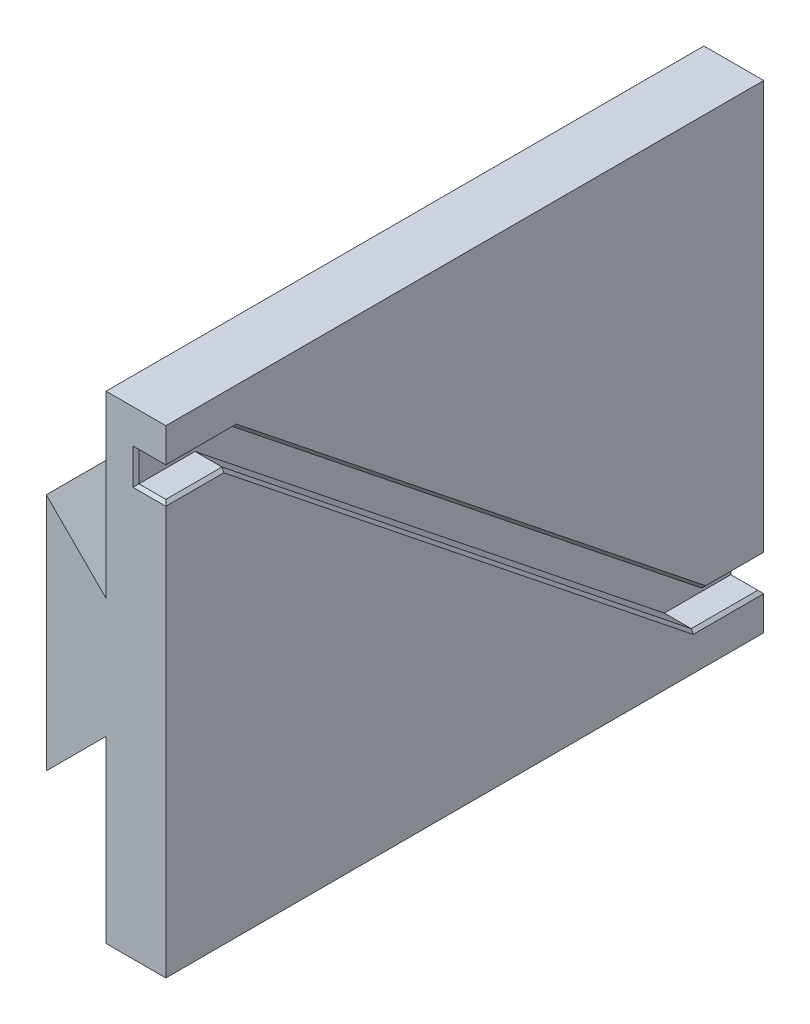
ISO-10303-21;
HEADER;
FILE_DESCRIPTION(('STEP AP214'),'2;1');
FILE_NAME('part.step','',(''),(''),'','','');
FILE_SCHEMA(('AUTOMOTIVE_DESIGN { 1 0 10303 214 1 1 1 1 }'));
ENDSEC;
DATA;
#1=APPLICATION_CONTEXT('core data for automotive mechanical design processes');
#2=APPLICATION_PROTOCOL_DEFINITION('international standard','automotive_design',2000,#1);
#3=PRODUCT_CONTEXT('',#1,'mechanical');
#4=PRODUCT('Part','Part','',(#3));
#5=PRODUCT_RELATED_PRODUCT_CATEGORY('part','',(#4));
#6=PRODUCT_DEFINITION_FORMATION('','',#4);
#7=PRODUCT_DEFINITION_CONTEXT('part definition',#1,'design');
#8=PRODUCT_DEFINITION('design','',#6,#7);
#9=PRODUCT_DEFINITION_SHAPE('','',#8);
#10=(LENGTH_UNIT() NAMED_UNIT(*) SI_UNIT(.MILLI.,.METRE.));
#11=(NAMED_UNIT(*) PLANE_ANGLE_UNIT() SI_UNIT($,.RADIAN.));
#12=(NAMED_UNIT(*) SI_UNIT($,.STERADIAN.) SOLID_ANGLE_UNIT());
#13=UNCERTAINTY_MEASURE_WITH_UNIT(LENGTH_MEASURE(1.E-05),#10,'distance_accuracy_value','');
#14=(GEOMETRIC_REPRESENTATION_CONTEXT(3) GLOBAL_UNCERTAINTY_ASSIGNED_CONTEXT((#13)) GLOBAL_UNIT_ASSIGNED_CONTEXT((#10,
#11,#12)) REPRESENTATION_CONTEXT('',''));
#15=CARTESIAN_POINT('',(0.,0.,0.));
#16=DIRECTION('',(0.,0.,1.));
#17=DIRECTION('',(1.,0.,0.));
#18=AXIS2_PLACEMENT_3D('',#15,#16,#17);
#19=CARTESIAN_POINT('',(0.,80.,100.));
#20=DIRECTION('',(-1.,0.,0.));
#21=DIRECTION('',(0.,0.,1.));
#22=AXIS2_PLACEMENT_3D('',#19,#20,#21);
#23=PLANE('',#22);
#24=DIRECTION('',(0.,-0.623846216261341,-0.781547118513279));
#25=VECTOR('',#24,1.);
#26=CARTESIAN_POINT('',(0.,84.5805321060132,96.3437295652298));
#27=LINE('',#26,#25);
#28=CARTESIAN_POINT('',(0.,68.660237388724,76.3989737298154));
#29=VERTEX_POINT('',#28);
#30=CARTESIAN_POINT('',(0.,-56.6602373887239,-80.6010262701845));
#31=VERTEX_POINT('',#30);
#32=EDGE_CURVE('E311',#29,#31,#27,.T.);
#33=ORIENTED_EDGE('',*,*,#32,.T.);
#34=DIRECTION('',(0.,0.,-1.));
#35=VECTOR('',#34,1.);
#36=CARTESIAN_POINT('',(0.,-56.6602373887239,100.));
#37=LINE('',#36,#35);
#38=CARTESIAN_POINT('',(0.,-56.6602373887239,-100.));
#39=VERTEX_POINT('',#38);
#40=EDGE_CURVE('E315',#31,#39,#37,.T.);
#41=ORIENTED_EDGE('',*,*,#40,.T.);
#42=DIRECTION('',(0.,1.,0.));
#43=VECTOR('',#42,1.);
#44=CARTESIAN_POINT('',(0.,80.,-100.));
#45=LINE('',#44,#43);
#46=CARTESIAN_POINT('',(0.,80.,-100.));
#47=VERTEX_POINT('',#46);
#48=EDGE_CURVE('E223',#39,#47,#45,.T.);
#49=ORIENTED_EDGE('',*,*,#48,.T.);
#50=DIRECTION('',(0.,0.,-1.));
#51=VECTOR('',#50,1.);
#52=CARTESIAN_POINT('',(0.,80.,100.));
#53=LINE('',#52,#51);
#54=CARTESIAN_POINT('',(0.,80.,100.));
#55=VERTEX_POINT('',#54);
#56=EDGE_CURVE('E283',#55,#47,#53,.T.);
#57=ORIENTED_EDGE('',*,*,#56,.F.);
#58=DIRECTION('',(0.,1.,0.));
#59=VECTOR('',#58,1.);
#60=CARTESIAN_POINT('',(0.,80.,100.));
#61=LINE('',#60,#59);
#62=CARTESIAN_POINT('',(0.,68.660237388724,100.));
#63=VERTEX_POINT('',#62);
#64=EDGE_CURVE('E231',#63,#55,#61,.T.);
#65=ORIENTED_EDGE('',*,*,#64,.F.);
#66=DIRECTION('',(0.,0.,-1.));
#67=VECTOR('',#66,1.);
#68=CARTESIAN_POINT('',(0.,68.660237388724,100.));
#69=LINE('',#68,#67);
#70=EDGE_CURVE('E313',#63,#29,#69,.T.);
#71=ORIENTED_EDGE('',*,*,#70,.T.);
#72=EDGE_LOOP('',(#33,#41,#49,#57,#65,#71));
#73=FACE_BOUND('',#72,.T.);
#74=ADVANCED_FACE('F35',(#73),#23,.F.);
#75=CARTESIAN_POINT('',(0.,-80.,-100.));
#76=VERTEX_POINT('',#75);
#77=CARTESIAN_POINT('',(0.,-68.660237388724,-100.));
#78=VERTEX_POINT('',#77);
#79=EDGE_CURVE('E246',#76,#78,#45,.T.);
#80=ORIENTED_EDGE('',*,*,#79,.T.);
#81=DIRECTION('',(0.,0.,1.));
#82=VECTOR('',#81,1.);
#83=CARTESIAN_POINT('',(0.,-68.660237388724,100.));
#84=LINE('',#83,#82);
#85=CARTESIAN_POINT('',(0.,-68.660237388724,-76.3989737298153));
#86=VERTEX_POINT('',#85);
#87=EDGE_CURVE('E309',#78,#86,#84,.T.);
#88=ORIENTED_EDGE('',*,*,#87,.T.);
#89=DIRECTION('',(0.,0.623846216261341,0.781547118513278));
#90=VECTOR('',#89,1.);
#91=CARTESIAN_POINT('',(0.,75.2019666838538,103.829884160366));
#92=LINE('',#91,#90);
#93=CARTESIAN_POINT('',(0.,56.6602373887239,80.6010262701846));
#94=VERTEX_POINT('',#93);
#95=EDGE_CURVE('E307',#86,#94,#92,.T.);
#96=ORIENTED_EDGE('',*,*,#95,.T.);
#97=DIRECTION('',(0.,0.,1.));
#98=VECTOR('',#97,1.);
#99=CARTESIAN_POINT('',(0.,56.6602373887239,100.));
#100=LINE('',#99,#98);
#101=CARTESIAN_POINT('',(0.,56.6602373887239,100.));
#102=VERTEX_POINT('',#101);
#103=EDGE_CURVE('E305',#94,#102,#100,.T.);
#104=ORIENTED_EDGE('',*,*,#103,.T.);
#105=CARTESIAN_POINT('',(0.,-80.,100.));
#106=VERTEX_POINT('',#105);
#107=EDGE_CURVE('E227',#106,#102,#61,.T.);
#108=ORIENTED_EDGE('',*,*,#107,.F.);
#109=DIRECTION('',(0.,0.,-1.));
#110=VECTOR('',#109,1.);
#111=CARTESIAN_POINT('',(0.,-80.,100.));
#112=LINE('',#111,#110);
#113=EDGE_CURVE('E245',#106,#76,#112,.T.);
#114=ORIENTED_EDGE('',*,*,#113,.T.);
#115=EDGE_LOOP('',(#80,#88,#96,#104,#108,#114));
#116=FACE_BOUND('',#115,.T.);
#117=ADVANCED_FACE('F435',(#116),#23,.F.);
#118=CARTESIAN_POINT('',(0.,80.,100.));
#119=DIRECTION('',(0.,-1.,0.));
#120=DIRECTION('',(0.,0.,-1.));
#121=AXIS2_PLACEMENT_3D('',#118,#119,#120);
#122=PLANE('',#121);
#123=DIRECTION('',(-1.,0.,0.));
#124=VECTOR('',#123,1.);
#125=CARTESIAN_POINT('',(0.,80.,-100.));
#126=LINE('',#125,#124);
#127=CARTESIAN_POINT('',(-20.,80.,-100.));
#128=VERTEX_POINT('',#127);
#129=EDGE_CURVE('E249',#47,#128,#126,.T.);
#130=ORIENTED_EDGE('',*,*,#129,.T.);
#131=DIRECTION('',(0.,0.,-1.));
#132=VECTOR('',#131,1.);
#133=CARTESIAN_POINT('',(-20.,80.,100.));
#134=LINE('',#133,#132);
#135=CARTESIAN_POINT('',(-20.,80.,100.));
#136=VERTEX_POINT('',#135);
#137=EDGE_CURVE('E280',#136,#128,#134,.T.);
#138=ORIENTED_EDGE('',*,*,#137,.F.);
#139=DIRECTION('',(-1.,0.,0.));
#140=VECTOR('',#139,1.);
#141=CARTESIAN_POINT('',(0.,80.,100.));
#142=LINE('',#141,#140);
#143=EDGE_CURVE('E230',#55,#136,#142,.T.);
#144=ORIENTED_EDGE('',*,*,#143,.F.);
#145=ORIENTED_EDGE('',*,*,#56,.T.);
#146=EDGE_LOOP('',(#130,#138,#144,#145));
#147=FACE_BOUND('',#146,.T.);
#148=ADVANCED_FACE('F399',(#147),#122,.F.);
#149=CARTESIAN_POINT('',(-20.,80.,100.));
#150=DIRECTION('',(1.,0.,0.));
#151=DIRECTION('',(0.,1.,0.));
#152=AXIS2_PLACEMENT_3D('',#149,#150,#151);
#153=PLANE('',#152);
#154=DIRECTION('',(0.,-1.,0.));
#155=VECTOR('',#154,1.);
#156=CARTESIAN_POINT('',(-20.,80.,-100.));
#157=LINE('',#156,#155);
#158=CARTESIAN_POINT('',(-20.,20.,-100.));
#159=VERTEX_POINT('',#158);
#160=EDGE_CURVE('E251',#128,#159,#157,.T.);
#161=ORIENTED_EDGE('',*,*,#160,.T.);
#162=DIRECTION('',(0.,0.,-1.));
#163=VECTOR('',#162,1.);
#164=CARTESIAN_POINT('',(-20.,20.,100.));
#165=LINE('',#164,#163);
#166=CARTESIAN_POINT('',(-20.,20.,100.));
#167=VERTEX_POINT('',#166);
#168=EDGE_CURVE('E277',#167,#159,#165,.T.);
#169=ORIENTED_EDGE('',*,*,#168,.F.);
#170=DIRECTION('',(0.,-1.,0.));
#171=VECTOR('',#170,1.);
#172=CARTESIAN_POINT('',(-20.,80.,100.));
#173=LINE('',#172,#171);
#174=EDGE_CURVE('E233',#136,#167,#173,.T.);
#175=ORIENTED_EDGE('',*,*,#174,.F.);
#176=ORIENTED_EDGE('',*,*,#137,.T.);
#177=EDGE_LOOP('',(#161,#169,#175,#176));
#178=FACE_BOUND('',#177,.T.);
#179=ADVANCED_FACE('F464',(#178),#153,.F.);
#180=CARTESIAN_POINT('',(-20.,20.,100.));
#181=DIRECTION('',(-0.707106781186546,-0.707106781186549,0.));
#182=DIRECTION('',(0.707106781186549,-0.707106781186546,0.));
#183=AXIS2_PLACEMENT_3D('',#180,#181,#182);
#184=PLANE('',#183);
#185=DIRECTION('',(-0.707106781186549,0.707106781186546,0.));
#186=VECTOR('',#185,1.);
#187=CARTESIAN_POINT('',(-20.,20.,-100.));
#188=LINE('',#187,#186);
#189=CARTESIAN_POINT('',(-40.,39.9999999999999,-100.));
#190=VERTEX_POINT('',#189);
#191=EDGE_CURVE('E253',#159,#190,#188,.T.);
#192=ORIENTED_EDGE('',*,*,#191,.T.);
#193=DIRECTION('',(0.,0.,-1.));
#194=VECTOR('',#193,1.);
#195=CARTESIAN_POINT('',(-40.,39.9999999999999,100.));
#196=LINE('',#195,#194);
#197=CARTESIAN_POINT('',(-40.,39.9999999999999,100.));
#198=VERTEX_POINT('',#197);
#199=EDGE_CURVE('E274',#198,#190,#196,.T.);
#200=ORIENTED_EDGE('',*,*,#199,.F.);
#201=DIRECTION('',(-0.707106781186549,0.707106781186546,0.));
#202=VECTOR('',#201,1.);
#203=CARTESIAN_POINT('',(-20.,20.,100.));
#204=LINE('',#203,#202);
#205=EDGE_CURVE('E235',#167,#198,#204,.T.);
#206=ORIENTED_EDGE('',*,*,#205,.F.);
#207=ORIENTED_EDGE('',*,*,#168,.T.);
#208=EDGE_LOOP('',(#192,#200,#206,#207));
#209=FACE_BOUND('',#208,.T.);
#210=ADVANCED_FACE('F459',(#209),#184,.F.);
#211=CARTESIAN_POINT('',(-40.,39.9999999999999,100.));
#212=DIRECTION('',(1.,0.,0.));
#213=DIRECTION('',(0.,0.,-1.));
#214=AXIS2_PLACEMENT_3D('',#211,#212,#213);
#215=PLANE('',#214);
#216=DIRECTION('',(0.,-1.,0.));
#217=VECTOR('',#216,1.);
#218=CARTESIAN_POINT('',(-40.,39.9999999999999,-100.));
#219=LINE('',#218,#217);
#220=CARTESIAN_POINT('',(-40.,-39.9999999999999,-100.));
#221=VERTEX_POINT('',#220);
#222=EDGE_CURVE('E255',#190,#221,#219,.T.);
#223=ORIENTED_EDGE('',*,*,#222,.T.);
#224=DIRECTION('',(0.,0.,-1.));
#225=VECTOR('',#224,1.);
#226=CARTESIAN_POINT('',(-40.,-39.9999999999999,100.));
#227=LINE('',#226,#225);
#228=CARTESIAN_POINT('',(-40.,-39.9999999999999,100.));
#229=VERTEX_POINT('',#228);
#230=EDGE_CURVE('E271',#229,#221,#227,.T.);
#231=ORIENTED_EDGE('',*,*,#230,.F.);
#232=DIRECTION('',(0.,-1.,0.));
#233=VECTOR('',#232,1.);
#234=CARTESIAN_POINT('',(-40.,39.9999999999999,100.));
#235=LINE('',#234,#233);
#236=EDGE_CURVE('E237',#198,#229,#235,.T.);
#237=ORIENTED_EDGE('',*,*,#236,.F.);
#238=ORIENTED_EDGE('',*,*,#199,.T.);
#239=EDGE_LOOP('',(#223,#231,#237,#238));
#240=FACE_BOUND('',#239,.T.);
#241=ADVANCED_FACE('F456',(#240),#215,.F.);
#242=CARTESIAN_POINT('',(-20.,-20.,100.));
#243=DIRECTION('',(-0.707106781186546,0.707106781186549,0.));
#244=DIRECTION('',(-0.707106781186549,-0.707106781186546,0.));
#245=AXIS2_PLACEMENT_3D('',#242,#243,#244);
#246=PLANE('',#245);
#247=DIRECTION('',(0.707106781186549,0.707106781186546,0.));
#248=VECTOR('',#247,1.);
#249=CARTESIAN_POINT('',(-20.,-20.,-100.));
#250=LINE('',#249,#248);
#251=CARTESIAN_POINT('',(-20.,-20.,-100.));
#252=VERTEX_POINT('',#251);
#253=EDGE_CURVE('E257',#221,#252,#250,.T.);
#254=ORIENTED_EDGE('',*,*,#253,.T.);
#255=DIRECTION('',(0.,0.,-1.));
#256=VECTOR('',#255,1.);
#257=CARTESIAN_POINT('',(-20.,-20.,100.));
#258=LINE('',#257,#256);
#259=CARTESIAN_POINT('',(-20.,-20.,100.));
#260=VERTEX_POINT('',#259);
#261=EDGE_CURVE('E268',#260,#252,#258,.T.);
#262=ORIENTED_EDGE('',*,*,#261,.F.);
#263=DIRECTION('',(0.707106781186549,0.707106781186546,0.));
#264=VECTOR('',#263,1.);
#265=CARTESIAN_POINT('',(-20.,-20.,100.));
#266=LINE('',#265,#264);
#267=EDGE_CURVE('E239',#229,#260,#266,.T.);
#268=ORIENTED_EDGE('',*,*,#267,.F.);
#269=ORIENTED_EDGE('',*,*,#230,.T.);
#270=EDGE_LOOP('',(#254,#262,#268,#269));
#271=FACE_BOUND('',#270,.T.);
#272=ADVANCED_FACE('F452',(#271),#246,.F.);
#273=CARTESIAN_POINT('',(-20.,-20.,100.));
#274=DIRECTION('',(1.,0.,0.));
#275=DIRECTION('',(0.,1.,0.));
#276=AXIS2_PLACEMENT_3D('',#273,#274,#275);
#277=PLANE('',#276);
#278=DIRECTION('',(0.,-1.,0.));
#279=VECTOR('',#278,1.);
#280=CARTESIAN_POINT('',(-20.,-20.,-100.));
#281=LINE('',#280,#279);
#282=CARTESIAN_POINT('',(-20.,-80.,-100.));
#283=VERTEX_POINT('',#282);
#284=EDGE_CURVE('E259',#252,#283,#281,.T.);
#285=ORIENTED_EDGE('',*,*,#284,.T.);
#286=DIRECTION('',(0.,0.,-1.));
#287=VECTOR('',#286,1.);
#288=CARTESIAN_POINT('',(-20.,-80.,100.));
#289=LINE('',#288,#287);
#290=CARTESIAN_POINT('',(-20.,-80.,100.));
#291=VERTEX_POINT('',#290);
#292=EDGE_CURVE('E265',#291,#283,#289,.T.);
#293=ORIENTED_EDGE('',*,*,#292,.F.);
#294=DIRECTION('',(0.,-1.,0.));
#295=VECTOR('',#294,1.);
#296=CARTESIAN_POINT('',(-20.,-20.,100.));
#297=LINE('',#296,#295);
#298=EDGE_CURVE('E241',#260,#291,#297,.T.);
#299=ORIENTED_EDGE('',*,*,#298,.F.);
#300=ORIENTED_EDGE('',*,*,#261,.T.);
#301=EDGE_LOOP('',(#285,#293,#299,#300));
#302=FACE_BOUND('',#301,.T.);
#303=ADVANCED_FACE('F447',(#302),#277,.F.);
#304=CARTESIAN_POINT('',(0.,-80.,100.));
#305=DIRECTION('',(0.,1.,0.));
#306=DIRECTION('',(0.,0.,1.));
#307=AXIS2_PLACEMENT_3D('',#304,#305,#306);
#308=PLANE('',#307);
#309=DIRECTION('',(1.,0.,0.));
#310=VECTOR('',#309,1.);
#311=CARTESIAN_POINT('',(0.,-80.,-100.));
#312=LINE('',#311,#310);
#313=EDGE_CURVE('E261',#283,#76,#312,.T.);
#314=ORIENTED_EDGE('',*,*,#313,.T.);
#315=ORIENTED_EDGE('',*,*,#113,.F.);
#316=DIRECTION('',(1.,0.,0.));
#317=VECTOR('',#316,1.);
#318=CARTESIAN_POINT('',(0.,-80.,100.));
#319=LINE('',#318,#317);
#320=EDGE_CURVE('E243',#291,#106,#319,.T.);
#321=ORIENTED_EDGE('',*,*,#320,.F.);
#322=ORIENTED_EDGE('',*,*,#292,.T.);
#323=EDGE_LOOP('',(#314,#315,#321,#322));
#324=FACE_BOUND('',#323,.T.);
#325=ADVANCED_FACE('F441',(#324),#308,.F.);
#326=CARTESIAN_POINT('',(0.,0.,100.));
#327=DIRECTION('',(0.,0.,-1.));
#328=DIRECTION('',(-1.,0.,0.));
#329=AXIS2_PLACEMENT_3D('',#326,#327,#328);
#330=PLANE('',#329);
#331=ORIENTED_EDGE('',*,*,#107,.T.);
#332=DIRECTION('',(-1.,0.,0.));
#333=VECTOR('',#332,1.);
#334=CARTESIAN_POINT('',(0.,56.6602373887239,100.));
#335=LINE('',#334,#333);
#336=CARTESIAN_POINT('',(-11.,56.6602373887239,100.));
#337=VERTEX_POINT('',#336);
#338=EDGE_CURVE('E326',#102,#337,#335,.T.);
#339=ORIENTED_EDGE('',*,*,#338,.T.);
#340=DIRECTION('',(0.,1.,0.));
#341=VECTOR('',#340,1.);
#342=CARTESIAN_POINT('',(-11.,67.660237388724,100.));
#343=LINE('',#342,#341);
#344=CARTESIAN_POINT('',(-11.,68.660237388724,100.));
#345=VERTEX_POINT('',#344);
#346=EDGE_CURVE('E324',#337,#345,#343,.T.);
#347=ORIENTED_EDGE('',*,*,#346,.T.);
#348=DIRECTION('',(1.,0.,0.));
#349=VECTOR('',#348,1.);
#350=CARTESIAN_POINT('',(0.,68.660237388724,100.));
#351=LINE('',#350,#349);
#352=EDGE_CURVE('E322',#345,#63,#351,.T.);
#353=ORIENTED_EDGE('',*,*,#352,.T.);
#354=ORIENTED_EDGE('',*,*,#64,.T.);
#355=ORIENTED_EDGE('',*,*,#143,.T.);
#356=ORIENTED_EDGE('',*,*,#174,.T.);
#357=ORIENTED_EDGE('',*,*,#205,.T.);
#358=ORIENTED_EDGE('',*,*,#236,.T.);
#359=ORIENTED_EDGE('',*,*,#267,.T.);
#360=ORIENTED_EDGE('',*,*,#298,.T.);
#361=ORIENTED_EDGE('',*,*,#320,.T.);
#362=EDGE_LOOP('',(#331,#339,#347,#353,#354,#355,#356,#357,#358,#359,#360,#361));
#363=FACE_BOUND('',#362,.T.);
#364=ADVANCED_FACE('F402',(#363),#330,.F.);
#365=CARTESIAN_POINT('',(0.,0.,-100.));
#366=DIRECTION('',(0.,0.,-1.));
#367=DIRECTION('',(-1.,0.,0.));
#368=AXIS2_PLACEMENT_3D('',#365,#366,#367);
#369=PLANE('',#368);
#370=DIRECTION('',(0.,-1.,0.));
#371=VECTOR('',#370,1.);
#372=CARTESIAN_POINT('',(-11.,0.,-100.));
#373=LINE('',#372,#371);
#374=CARTESIAN_POINT('',(-11.,-56.6602373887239,-100.));
#375=VERTEX_POINT('',#374);
#376=CARTESIAN_POINT('',(-11.,-68.660237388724,-100.));
#377=VERTEX_POINT('',#376);
#378=EDGE_CURVE('E288',#375,#377,#373,.T.);
#379=ORIENTED_EDGE('',*,*,#378,.T.);
#380=DIRECTION('',(1.,0.,0.));
#381=VECTOR('',#380,1.);
#382=CARTESIAN_POINT('',(0.,-68.660237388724,-100.));
#383=LINE('',#382,#381);
#384=EDGE_CURVE('E290',#377,#78,#383,.T.);
#385=ORIENTED_EDGE('',*,*,#384,.T.);
#386=ORIENTED_EDGE('',*,*,#79,.F.);
#387=ORIENTED_EDGE('',*,*,#313,.F.);
#388=ORIENTED_EDGE('',*,*,#284,.F.);
#389=ORIENTED_EDGE('',*,*,#253,.F.);
#390=ORIENTED_EDGE('',*,*,#222,.F.);
#391=ORIENTED_EDGE('',*,*,#191,.F.);
#392=ORIENTED_EDGE('',*,*,#160,.F.);
#393=ORIENTED_EDGE('',*,*,#129,.F.);
#394=ORIENTED_EDGE('',*,*,#48,.F.);
#395=DIRECTION('',(-1.,0.,0.));
#396=VECTOR('',#395,1.);
#397=CARTESIAN_POINT('',(-10.,-56.6602373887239,-100.));
#398=LINE('',#397,#396);
#399=EDGE_CURVE('E286',#39,#375,#398,.T.);
#400=ORIENTED_EDGE('',*,*,#399,.T.);
#401=EDGE_LOOP('',(#379,#385,#386,#387,#388,#389,#390,#391,#392,#393,#394,#400));
#402=FACE_BOUND('',#401,.T.);
#403=ADVANCED_FACE('F392',(#402),#369,.T.);
#404=CARTESIAN_POINT('',(-10.,67.660237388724,100.));
#405=DIRECTION('',(0.,1.,0.));
#406=DIRECTION('',(0.,0.,1.));
#407=AXIS2_PLACEMENT_3D('',#404,#405,#406);
#408=PLANE('',#407);
#409=DIRECTION('',(0.,0.,1.));
#410=VECTOR('',#409,1.);
#411=CARTESIAN_POINT('',(-1.00000000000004,67.660237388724,100.));
#412=LINE('',#411,#410);
#413=CARTESIAN_POINT('',(-1.00000000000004,67.660237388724,76.7491447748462));
#414=VERTEX_POINT('',#413);
#415=CARTESIAN_POINT('',(-1.00000000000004,67.660237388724,99.));
#416=VERTEX_POINT('',#415);
#417=EDGE_CURVE('E53',#414,#416,#412,.T.);
#418=ORIENTED_EDGE('',*,*,#417,.T.);
#419=DIRECTION('',(-1.,0.,0.));
#420=VECTOR('',#419,1.);
#421=CARTESIAN_POINT('',(-10.,67.660237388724,99.));
#422=LINE('',#421,#420);
#423=CARTESIAN_POINT('',(-10.,67.660237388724,99.));
#424=VERTEX_POINT('',#423);
#425=EDGE_CURVE('E45',#416,#424,#422,.T.);
#426=ORIENTED_EDGE('',*,*,#425,.T.);
#427=DIRECTION('',(0.,0.,1.));
#428=VECTOR('',#427,1.);
#429=CARTESIAN_POINT('',(-10.,67.660237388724,100.));
#430=LINE('',#429,#428);
#431=CARTESIAN_POINT('',(-10.,67.660237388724,76.7491447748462));
#432=VERTEX_POINT('',#431);
#433=EDGE_CURVE('E206',#432,#424,#430,.T.);
#434=ORIENTED_EDGE('',*,*,#433,.F.);
#435=DIRECTION('',(1.,0.,0.));
#436=VECTOR('',#435,1.);
#437=CARTESIAN_POINT('',(-10.,67.660237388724,76.7491447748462));
#438=LINE('',#437,#436);
#439=EDGE_CURVE('E221',#432,#414,#438,.T.);
#440=ORIENTED_EDGE('',*,*,#439,.T.);
#441=EDGE_LOOP('',(#418,#426,#434,#440));
#442=FACE_BOUND('',#441,.T.);
#443=ADVANCED_FACE('F371',(#442),#408,.F.);
#444=CARTESIAN_POINT('',(-10.,67.660237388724,76.7491447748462));
#445=DIRECTION('',(0.,0.781547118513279,-0.623846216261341));
#446=DIRECTION('',(0.,0.623846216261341,0.781547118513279));
#447=AXIS2_PLACEMENT_3D('',#444,#445,#446);
#448=PLANE('',#447);
#449=DIRECTION('',(1.,0.,0.));
#450=VECTOR('',#449,1.);
#451=CARTESIAN_POINT('',(-10.,-57.6602373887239,-80.2508552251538));
#452=LINE('',#451,#450);
#453=CARTESIAN_POINT('',(-10.,-57.6602373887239,-80.2508552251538));
#454=VERTEX_POINT('',#453);
#455=CARTESIAN_POINT('',(-1.00000000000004,-57.6602373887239,-80.2508552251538));
#456=VERTEX_POINT('',#455);
#457=EDGE_CURVE('E224',#454,#456,#452,.T.);
#458=ORIENTED_EDGE('',*,*,#457,.T.);
#459=DIRECTION('',(0.,0.623846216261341,0.781547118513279));
#460=VECTOR('',#459,1.);
#461=CARTESIAN_POINT('',(-1.00000000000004,67.660237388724,76.7491447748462));
#462=LINE('',#461,#460);
#463=EDGE_CURVE('E11',#456,#414,#462,.T.);
#464=ORIENTED_EDGE('',*,*,#463,.T.);
#465=ORIENTED_EDGE('',*,*,#439,.F.);
#466=DIRECTION('',(0.,0.623846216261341,0.781547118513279));
#467=VECTOR('',#466,1.);
#468=CARTESIAN_POINT('',(-10.,67.660237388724,76.7491447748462));
#469=LINE('',#468,#467);
#470=EDGE_CURVE('E217',#454,#432,#469,.T.);
#471=ORIENTED_EDGE('',*,*,#470,.F.);
#472=EDGE_LOOP('',(#458,#464,#465,#471));
#473=FACE_BOUND('',#472,.T.);
#474=ADVANCED_FACE('F375',(#473),#448,.F.);
#475=CARTESIAN_POINT('',(-10.,-57.6602373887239,-80.2508552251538));
#476=DIRECTION('',(0.,1.,0.));
#477=DIRECTION('',(0.,0.,1.));
#478=AXIS2_PLACEMENT_3D('',#475,#476,#477);
#479=PLANE('',#478);
#480=DIRECTION('',(0.,0.,1.));
#481=VECTOR('',#480,1.);
#482=CARTESIAN_POINT('',(-10.,-57.6602373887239,-80.2508552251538));
#483=LINE('',#482,#481);
#484=CARTESIAN_POINT('',(-10.,-57.6602373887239,-98.9999999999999));
#485=VERTEX_POINT('',#484);
#486=EDGE_CURVE('E213',#485,#454,#483,.T.);
#487=ORIENTED_EDGE('',*,*,#486,.F.);
#488=DIRECTION('',(1.,0.,0.));
#489=VECTOR('',#488,1.);
#490=CARTESIAN_POINT('',(0.,-57.6602373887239,-98.9999999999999));
#491=LINE('',#490,#489);
#492=CARTESIAN_POINT('',(-1.00000000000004,-57.6602373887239,-98.9999999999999));
#493=VERTEX_POINT('',#492);
#494=EDGE_CURVE('E303',#485,#493,#491,.T.);
#495=ORIENTED_EDGE('',*,*,#494,.T.);
#496=DIRECTION('',(0.,0.,1.));
#497=VECTOR('',#496,1.);
#498=CARTESIAN_POINT('',(-1.00000000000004,-57.6602373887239,-80.2508552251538));
#499=LINE('',#498,#497);
#500=EDGE_CURVE('E301',#493,#456,#499,.T.);
#501=ORIENTED_EDGE('',*,*,#500,.T.);
#502=ORIENTED_EDGE('',*,*,#457,.F.);
#503=EDGE_LOOP('',(#487,#495,#501,#502));
#504=FACE_BOUND('',#503,.T.);
#505=ADVANCED_FACE('F425',(#504),#479,.F.);
#506=CARTESIAN_POINT('',(-10.,-67.6602373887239,-76.7491447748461));
#507=DIRECTION('',(0.,-1.,0.));
#508=DIRECTION('',(0.,0.,-1.));
#509=AXIS2_PLACEMENT_3D('',#506,#507,#508);
#510=PLANE('',#509);
#511=DIRECTION('',(0.,0.,-1.));
#512=VECTOR('',#511,1.);
#513=CARTESIAN_POINT('',(-1.00000000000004,-67.6602373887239,-76.7491447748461));
#514=LINE('',#513,#512);
#515=CARTESIAN_POINT('',(-1.00000000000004,-67.6602373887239,-76.7491447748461));
#516=VERTEX_POINT('',#515);
#517=CARTESIAN_POINT('',(-1.00000000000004,-67.6602373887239,-99.));
#518=VERTEX_POINT('',#517);
#519=EDGE_CURVE('E293',#516,#518,#514,.T.);
#520=ORIENTED_EDGE('',*,*,#519,.T.);
#521=DIRECTION('',(-1.,0.,0.));
#522=VECTOR('',#521,1.);
#523=CARTESIAN_POINT('',(-10.,-67.6602373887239,-99.));
#524=LINE('',#523,#522);
#525=CARTESIAN_POINT('',(-10.,-67.6602373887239,-98.9999999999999));
#526=VERTEX_POINT('',#525);
#527=EDGE_CURVE('E295',#518,#526,#524,.T.);
#528=ORIENTED_EDGE('',*,*,#527,.T.);
#529=DIRECTION('',(0.,0.,-1.));
#530=VECTOR('',#529,1.);
#531=CARTESIAN_POINT('',(-10.,-67.6602373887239,-76.7491447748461));
#532=LINE('',#531,#530);
#533=CARTESIAN_POINT('',(-10.,-67.6602373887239,-76.7491447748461));
#534=VERTEX_POINT('',#533);
#535=EDGE_CURVE('E211',#534,#526,#532,.T.);
#536=ORIENTED_EDGE('',*,*,#535,.F.);
#537=DIRECTION('',(1.,0.,0.));
#538=VECTOR('',#537,1.);
#539=CARTESIAN_POINT('',(-10.,-67.6602373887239,-76.7491447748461));
#540=LINE('',#539,#538);
#541=EDGE_CURVE('E205',#534,#516,#540,.T.);
#542=ORIENTED_EDGE('',*,*,#541,.T.);
#543=EDGE_LOOP('',(#520,#528,#536,#542));
#544=FACE_BOUND('',#543,.T.);
#545=ADVANCED_FACE('F419',(#544),#510,.F.);
#546=CARTESIAN_POINT('',(-10.,57.660237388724,80.2508552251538));
#547=DIRECTION('',(0.,-0.781547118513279,0.623846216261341));
#548=DIRECTION('',(0.,-0.623846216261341,-0.781547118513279));
#549=AXIS2_PLACEMENT_3D('',#546,#547,#548);
#550=PLANE('',#549);
#551=DIRECTION('',(1.,0.,0.));
#552=VECTOR('',#551,1.);
#553=CARTESIAN_POINT('',(-10.,57.660237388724,80.2508552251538));
#554=LINE('',#553,#552);
#555=CARTESIAN_POINT('',(-10.,57.660237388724,80.2508552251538));
#556=VERTEX_POINT('',#555);
#557=CARTESIAN_POINT('',(-1.00000000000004,57.660237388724,80.2508552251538));
#558=VERTEX_POINT('',#557);
#559=EDGE_CURVE('E199',#556,#558,#554,.T.);
#560=ORIENTED_EDGE('',*,*,#559,.T.);
#561=DIRECTION('',(0.,-0.623846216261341,-0.781547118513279));
#562=VECTOR('',#561,1.);
#563=CARTESIAN_POINT('',(-1.00000000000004,57.660237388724,80.2508552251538));
#564=LINE('',#563,#562);
#565=EDGE_CURVE('E317',#558,#516,#564,.T.);
#566=ORIENTED_EDGE('',*,*,#565,.T.);
#567=ORIENTED_EDGE('',*,*,#541,.F.);
#568=DIRECTION('',(0.,-0.623846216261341,-0.781547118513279));
#569=VECTOR('',#568,1.);
#570=CARTESIAN_POINT('',(-10.,57.660237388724,80.2508552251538));
#571=LINE('',#570,#569);
#572=EDGE_CURVE('E191',#556,#534,#571,.T.);
#573=ORIENTED_EDGE('',*,*,#572,.F.);
#574=EDGE_LOOP('',(#560,#566,#567,#573));
#575=FACE_BOUND('',#574,.T.);
#576=ADVANCED_FACE('F208',(#575),#550,.F.);
#577=CARTESIAN_POINT('',(-10.,57.660237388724,100.));
#578=DIRECTION('',(0.,-1.,0.));
#579=DIRECTION('',(0.,0.,-1.));
#580=AXIS2_PLACEMENT_3D('',#577,#578,#579);
#581=PLANE('',#580);
#582=DIRECTION('',(1.,0.,0.));
#583=VECTOR('',#582,1.);
#584=CARTESIAN_POINT('',(-10.,57.660237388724,98.9999999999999));
#585=LINE('',#584,#583);
#586=CARTESIAN_POINT('',(-10.,57.660237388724,98.9999999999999));
#587=VERTEX_POINT('',#586);
#588=CARTESIAN_POINT('',(-1.00000000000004,57.660237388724,98.9999999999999));
#589=VERTEX_POINT('',#588);
#590=EDGE_CURVE('E319',#587,#589,#585,.T.);
#591=ORIENTED_EDGE('',*,*,#590,.T.);
#592=DIRECTION('',(0.,0.,-1.));
#593=VECTOR('',#592,1.);
#594=CARTESIAN_POINT('',(-1.00000000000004,57.660237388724,100.));
#595=LINE('',#594,#593);
#596=EDGE_CURVE('E202',#589,#558,#595,.T.);
#597=ORIENTED_EDGE('',*,*,#596,.T.);
#598=ORIENTED_EDGE('',*,*,#559,.F.);
#599=DIRECTION('',(0.,0.,-1.));
#600=VECTOR('',#599,1.);
#601=CARTESIAN_POINT('',(-10.,57.660237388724,100.));
#602=LINE('',#601,#600);
#603=EDGE_CURVE('E186',#587,#556,#602,.T.);
#604=ORIENTED_EDGE('',*,*,#603,.F.);
#605=EDGE_LOOP('',(#591,#597,#598,#604));
#606=FACE_BOUND('',#605,.T.);
#607=ADVANCED_FACE('F200',(#606),#581,.F.);
#608=CARTESIAN_POINT('',(-10.,0.,0.));
#609=DIRECTION('',(1.,0.,0.));
#610=DIRECTION('',(0.,0.,-1.));
#611=AXIS2_PLACEMENT_3D('',#608,#609,#610);
#612=PLANE('',#611);
#613=ORIENTED_EDGE('',*,*,#535,.T.);
#614=DIRECTION('',(0.,1.,0.));
#615=VECTOR('',#614,1.);
#616=CARTESIAN_POINT('',(-10.,0.,-98.9999999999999));
#617=LINE('',#616,#615);
#618=EDGE_CURVE('E299',#526,#485,#617,.T.);
#619=ORIENTED_EDGE('',*,*,#618,.T.);
#620=ORIENTED_EDGE('',*,*,#486,.T.);
#621=ORIENTED_EDGE('',*,*,#470,.T.);
#622=ORIENTED_EDGE('',*,*,#433,.T.);
#623=DIRECTION('',(0.,-1.,0.));
#624=VECTOR('',#623,1.);
#625=CARTESIAN_POINT('',(-10.,57.660237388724,98.9999999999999));
#626=LINE('',#625,#624);
#627=EDGE_CURVE('E194',#424,#587,#626,.T.);
#628=ORIENTED_EDGE('',*,*,#627,.T.);
#629=ORIENTED_EDGE('',*,*,#603,.T.);
#630=ORIENTED_EDGE('',*,*,#572,.T.);
#631=EDGE_LOOP('',(#613,#619,#620,#621,#622,#628,#629,#630));
#632=FACE_BOUND('',#631,.T.);
#633=ADVANCED_FACE('F189',(#632),#612,.T.);
#634=CARTESIAN_POINT('',(0.,68.660237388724,100.));
#635=DIRECTION('',(0.,0.707106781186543,-0.707106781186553));
#636=DIRECTION('',(1.,0.,0.));
#637=AXIS2_PLACEMENT_3D('',#634,#635,#636);
#638=PLANE('',#637);
#639=DIRECTION('',(-0.577350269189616,0.577350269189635,0.577350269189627));
#640=VECTOR('',#639,1.);
#641=CARTESIAN_POINT('',(12.5534124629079,45.1068249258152,76.4465875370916));
#642=LINE('',#641,#640);
#643=EDGE_CURVE('E357',#424,#345,#642,.T.);
#644=ORIENTED_EDGE('',*,*,#643,.F.);
#645=ORIENTED_EDGE('',*,*,#425,.F.);
#646=DIRECTION('',(-0.577350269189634,-0.577350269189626,-0.577350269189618));
#647=VECTOR('',#646,1.);
#648=CARTESIAN_POINT('',(-0.666666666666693,67.9935707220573,99.3333333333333));
#649=LINE('',#648,#647);
#650=EDGE_CURVE('E40',#63,#416,#649,.T.);
#651=ORIENTED_EDGE('',*,*,#650,.F.);
#652=ORIENTED_EDGE('',*,*,#352,.F.);
#653=EDGE_LOOP('',(#644,#645,#651,#652));
#654=FACE_BOUND('',#653,.T.);
#655=ADVANCED_FACE('F38',(#654),#638,.F.);
#656=CARTESIAN_POINT('',(-1.00000000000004,67.660237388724,100.));
#657=DIRECTION('',(-0.707106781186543,0.707106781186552,0.));
#658=DIRECTION('',(0.,0.,1.));
#659=AXIS2_PLACEMENT_3D('',#656,#657,#658);
#660=PLANE('',#659);
#661=ORIENTED_EDGE('',*,*,#650,.T.);
#662=ORIENTED_EDGE('',*,*,#417,.F.);
#663=DIRECTION('',(-0.686378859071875,-0.686378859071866,0.240350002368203));
#664=VECTOR('',#663,1.);
#665=CARTESIAN_POINT('',(-4.83572056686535,63.8245168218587,78.0923030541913));
#666=LINE('',#665,#664);
#667=EDGE_CURVE('E355',#29,#414,#666,.T.);
#668=ORIENTED_EDGE('',*,*,#667,.F.);
#669=ORIENTED_EDGE('',*,*,#70,.F.);
#670=EDGE_LOOP('',(#661,#662,#668,#669));
#671=FACE_BOUND('',#670,.T.);
#672=ADVANCED_FACE('F366',(#671),#660,.F.);
#673=CARTESIAN_POINT('',(-10.,0.,98.9999999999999));
#674=DIRECTION('',(0.707106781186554,0.,0.707106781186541));
#675=DIRECTION('',(0.,1.,0.));
#676=AXIS2_PLACEMENT_3D('',#673,#674,#675);
#677=PLANE('',#676);
#678=ORIENTED_EDGE('',*,*,#643,.T.);
#679=ORIENTED_EDGE('',*,*,#346,.F.);
#680=DIRECTION('',(-0.577350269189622,-0.577350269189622,0.577350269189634));
#681=VECTOR('',#680,1.);
#682=CARTESIAN_POINT('',(-10.,57.660237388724,98.9999999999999));
#683=LINE('',#682,#681);
#684=EDGE_CURVE('E352',#587,#337,#683,.T.);
#685=ORIENTED_EDGE('',*,*,#684,.F.);
#686=ORIENTED_EDGE('',*,*,#627,.F.);
#687=EDGE_LOOP('',(#678,#679,#685,#686));
#688=FACE_BOUND('',#687,.T.);
#689=ADVANCED_FACE('F404',(#688),#677,.T.);
#690=CARTESIAN_POINT('',(-1.00000000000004,67.660237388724,76.7491447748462));
#691=DIRECTION('',(-0.707106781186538,0.552637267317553,-0.441125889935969));
#692=DIRECTION('',(0.,0.623846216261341,0.781547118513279));
#693=AXIS2_PLACEMENT_3D('',#690,#691,#692);
#694=PLANE('',#693);
#695=ORIENTED_EDGE('',*,*,#667,.T.);
#696=ORIENTED_EDGE('',*,*,#463,.F.);
#697=DIRECTION('',(0.686378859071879,0.686378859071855,-0.240350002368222));
#698=VECTOR('',#697,1.);
#699=CARTESIAN_POINT('',(32.1400008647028,-24.5202365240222,-91.8555239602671));
#700=LINE('',#699,#698);
#701=EDGE_CURVE('E349',#31,#456,#700,.F.);
#702=ORIENTED_EDGE('',*,*,#701,.F.);
#703=ORIENTED_EDGE('',*,*,#32,.F.);
#704=EDGE_LOOP('',(#695,#696,#702,#703));
#705=FACE_BOUND('',#704,.T.);
#706=ADVANCED_FACE('F379',(#705),#694,.F.);
#707=CARTESIAN_POINT('',(-10.,57.660237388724,98.9999999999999));
#708=DIRECTION('',(0.,-0.707106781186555,-0.70710678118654));
#709=DIRECTION('',(1.,0.,0.));
#710=AXIS2_PLACEMENT_3D('',#707,#708,#709);
#711=PLANE('',#710);
#712=ORIENTED_EDGE('',*,*,#684,.T.);
#713=ORIENTED_EDGE('',*,*,#338,.F.);
#714=DIRECTION('',(-0.57735026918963,0.577350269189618,-0.57735026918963));
#715=VECTOR('',#714,1.);
#716=CARTESIAN_POINT('',(-4.00000000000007,60.6602373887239,95.9999999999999));
#717=LINE('',#716,#715);
#718=EDGE_CURVE('E346',#589,#102,#717,.F.);
#719=ORIENTED_EDGE('',*,*,#718,.F.);
#720=ORIENTED_EDGE('',*,*,#590,.F.);
#721=EDGE_LOOP('',(#712,#713,#719,#720));
#722=FACE_BOUND('',#721,.T.);
#723=ADVANCED_FACE('F407',(#722),#711,.F.);
#724=CARTESIAN_POINT('',(-1.00000000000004,-57.6602373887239,-80.2508552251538));
#725=DIRECTION('',(-0.707106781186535,0.70710678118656,0.));
#726=DIRECTION('',(0.,0.,1.));
#727=AXIS2_PLACEMENT_3D('',#724,#725,#726);
#728=PLANE('',#727);
#729=ORIENTED_EDGE('',*,*,#701,.T.);
#730=ORIENTED_EDGE('',*,*,#500,.F.);
#731=DIRECTION('',(-0.577350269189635,-0.577350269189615,0.577350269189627));
#732=VECTOR('',#731,1.);
#733=CARTESIAN_POINT('',(-7.24971492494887,-63.9099523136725,-92.7502850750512));
#734=LINE('',#733,#732);
#735=EDGE_CURVE('E343',#39,#493,#734,.T.);
#736=ORIENTED_EDGE('',*,*,#735,.F.);
#737=ORIENTED_EDGE('',*,*,#40,.F.);
#738=EDGE_LOOP('',(#729,#730,#736,#737));
#739=FACE_BOUND('',#738,.T.);
#740=ADVANCED_FACE('F384',(#739),#728,.F.);
#741=CARTESIAN_POINT('',(-1.00000000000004,57.660237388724,100.));
#742=DIRECTION('',(-0.70710678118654,-0.707106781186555,0.));
#743=DIRECTION('',(0.,0.,-1.));
#744=AXIS2_PLACEMENT_3D('',#741,#742,#743);
#745=PLANE('',#744);
#746=ORIENTED_EDGE('',*,*,#718,.T.);
#747=ORIENTED_EDGE('',*,*,#103,.F.);
#748=DIRECTION('',(-0.686378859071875,0.686378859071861,-0.240350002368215));
#749=VECTOR('',#748,1.);
#750=CARTESIAN_POINT('',(2.25803933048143,54.4021980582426,81.3917262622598));
#751=LINE('',#750,#749);
#752=EDGE_CURVE('E340',#558,#94,#751,.F.);
#753=ORIENTED_EDGE('',*,*,#752,.F.);
#754=ORIENTED_EDGE('',*,*,#596,.F.);
#755=EDGE_LOOP('',(#746,#747,#753,#754));
#756=FACE_BOUND('',#755,.T.);
#757=ADVANCED_FACE('F411',(#756),#745,.F.);
#758=CARTESIAN_POINT('',(-10.,-57.6602373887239,-98.9999999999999));
#759=DIRECTION('',(0.,-0.707106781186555,-0.70710678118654));
#760=DIRECTION('',(-1.,0.,0.));
#761=AXIS2_PLACEMENT_3D('',#758,#759,#760);
#762=PLANE('',#761);
#763=ORIENTED_EDGE('',*,*,#735,.T.);
#764=ORIENTED_EDGE('',*,*,#494,.F.);
#765=DIRECTION('',(0.577350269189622,-0.577350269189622,0.577350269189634));
#766=VECTOR('',#765,1.);
#767=CARTESIAN_POINT('',(-29.2200791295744,-38.4401582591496,-118.220079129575));
#768=LINE('',#767,#766);
#769=EDGE_CURVE('E337',#375,#485,#768,.T.);
#770=ORIENTED_EDGE('',*,*,#769,.F.);
#771=ORIENTED_EDGE('',*,*,#399,.F.);
#772=EDGE_LOOP('',(#763,#764,#770,#771));
#773=FACE_BOUND('',#772,.T.);
#774=ADVANCED_FACE('F427',(#773),#762,.T.);
#775=CARTESIAN_POINT('',(-1.00000000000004,57.660237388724,80.2508552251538));
#776=DIRECTION('',(-0.70710678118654,-0.552637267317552,0.441125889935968));
#777=DIRECTION('',(0.,-0.623846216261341,-0.781547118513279));
#778=AXIS2_PLACEMENT_3D('',#775,#776,#777);
#779=PLANE('',#778);
#780=ORIENTED_EDGE('',*,*,#752,.T.);
#781=ORIENTED_EDGE('',*,*,#95,.F.);
#782=DIRECTION('',(-0.686378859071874,0.686378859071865,-0.240350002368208));
#783=VECTOR('',#782,1.);
#784=CARTESIAN_POINT('',(-1.00000000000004,-67.6602373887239,-76.7491447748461));
#785=LINE('',#784,#783);
#786=EDGE_CURVE('E334',#516,#86,#785,.F.);
#787=ORIENTED_EDGE('',*,*,#786,.F.);
#788=ORIENTED_EDGE('',*,*,#565,.F.);
#789=EDGE_LOOP('',(#780,#781,#787,#788));
#790=FACE_BOUND('',#789,.T.);
#791=ADVANCED_FACE('F416',(#790),#779,.F.);
#792=CARTESIAN_POINT('',(-10.,0.,-98.9999999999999));
#793=DIRECTION('',(-0.707106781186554,0.,0.707106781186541));
#794=DIRECTION('',(0.,1.,0.));
#795=AXIS2_PLACEMENT_3D('',#792,#793,#794);
#796=PLANE('',#795);
#797=ORIENTED_EDGE('',*,*,#769,.T.);
#798=ORIENTED_EDGE('',*,*,#618,.F.);
#799=DIRECTION('',(0.577350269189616,0.577350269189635,0.577350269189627));
#800=VECTOR('',#799,1.);
#801=CARTESIAN_POINT('',(-7.33333333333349,-64.9935707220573,-96.3333333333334));
#802=LINE('',#801,#800);
#803=EDGE_CURVE('E332',#377,#526,#802,.T.);
#804=ORIENTED_EDGE('',*,*,#803,.F.);
#805=ORIENTED_EDGE('',*,*,#378,.F.);
#806=EDGE_LOOP('',(#797,#798,#804,#805));
#807=FACE_BOUND('',#806,.T.);
#808=ADVANCED_FACE('F429',(#807),#796,.F.);
#809=CARTESIAN_POINT('',(-1.00000000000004,-67.6602373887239,-76.7491447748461));
#810=DIRECTION('',(-0.707106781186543,-0.707106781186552,0.));
#811=DIRECTION('',(0.,0.,-1.));
#812=AXIS2_PLACEMENT_3D('',#809,#810,#811);
#813=PLANE('',#812);
#814=ORIENTED_EDGE('',*,*,#786,.T.);
#815=ORIENTED_EDGE('',*,*,#87,.F.);
#816=DIRECTION('',(0.577350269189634,-0.577350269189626,-0.577350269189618));
#817=VECTOR('',#816,1.);
#818=CARTESIAN_POINT('',(-8.41695174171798,-60.2432856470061,-91.5830482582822));
#819=LINE('',#818,#817);
#820=EDGE_CURVE('E330',#518,#78,#819,.T.);
#821=ORIENTED_EDGE('',*,*,#820,.F.);
#822=ORIENTED_EDGE('',*,*,#519,.F.);
#823=EDGE_LOOP('',(#814,#815,#821,#822));
#824=FACE_BOUND('',#823,.T.);
#825=ADVANCED_FACE('F486',(#824),#813,.F.);
#826=CARTESIAN_POINT('',(0.,-68.660237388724,-100.));
#827=DIRECTION('',(0.,0.707106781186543,-0.707106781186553));
#828=DIRECTION('',(-1.,0.,0.));
#829=AXIS2_PLACEMENT_3D('',#826,#827,#828);
#830=PLANE('',#829);
#831=ORIENTED_EDGE('',*,*,#803,.T.);
#832=ORIENTED_EDGE('',*,*,#527,.F.);
#833=ORIENTED_EDGE('',*,*,#820,.T.);
#834=ORIENTED_EDGE('',*,*,#384,.F.);
#835=EDGE_LOOP('',(#831,#832,#833,#834));
#836=FACE_BOUND('',#835,.T.);
#837=ADVANCED_FACE('F480',(#836),#830,.T.);
#838=CLOSED_SHELL('',(#74,#117,#148,#179,#210,#241,#272,#303,#325,#364,#403,#443,#474,#505,#545,
#576,#607,#633,#655,#672,#689,#706,#723,#740,#757,#774,#791,#808,#825,#837));
#839=MANIFOLD_SOLID_BREP('B2',#838);
#840=ADVANCED_BREP_SHAPE_REPRESENTATION('',(#18,#839),#14);
#841=SHAPE_DEFINITION_REPRESENTATION(#9,#840);
ENDSEC;
END-ISO-10303-21;
